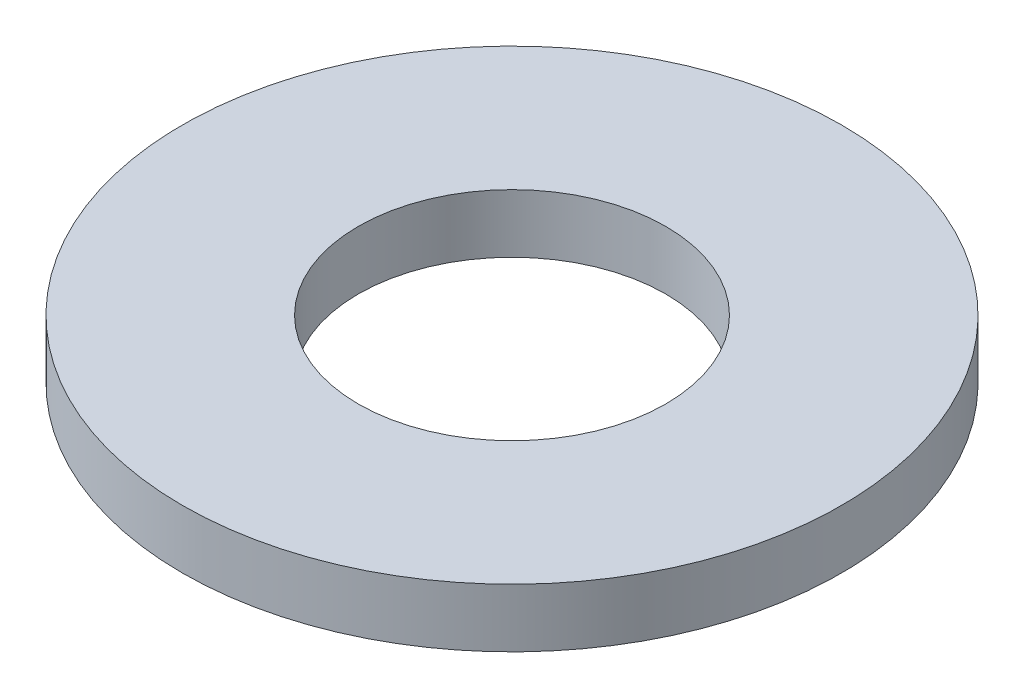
from build123d import *

# Parameters (mm, degrees)
SKETCH1_R           = 4.5
SKETCH1_R_2         = 2.1
BOSS_EXTRUDE1_DEPTH = 0.8


with BuildPart() as part:
    # Sketch1 → Boss-Extrude1 (new body)
    with BuildSketch(Plane(origin=(0, 0, 0), x_dir=(1, 0, 0), z_dir=(0, 1, 0))):
        with Locations(Location((0, 0, 0), (0, 0, 270))):
            Circle(SKETCH1_R)
        with Locations(Location((0, 0, 0), (0, 0, 270))):
            Circle(SKETCH1_R_2, mode=Mode.SUBTRACT)
    extrude(amount=BOSS_EXTRUDE1_DEPTH)


solid = part.part
